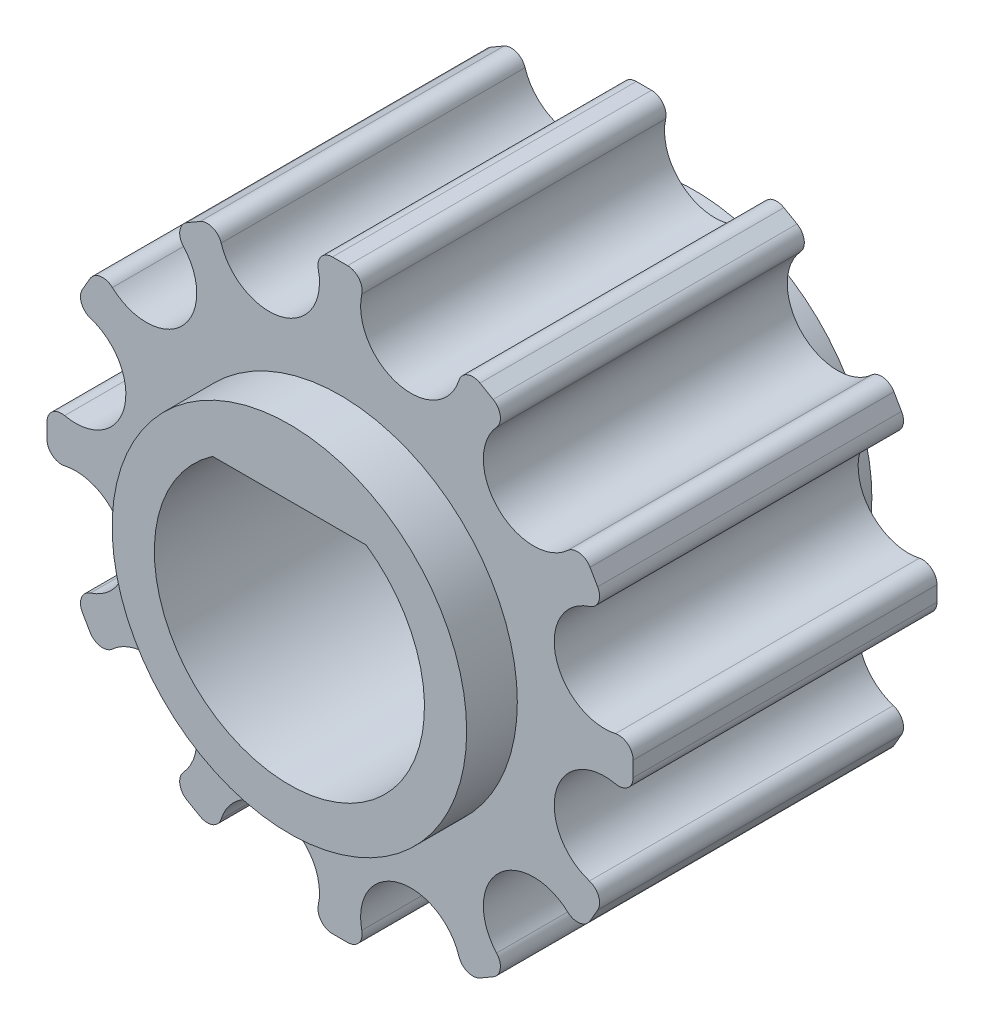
from build123d import *

# Parameters (mm, degrees)
SKETCH2_R               = 9.549296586
PD_DEPTH                = 4.5
TEETH_DEPTH             = 9
CIRPATTERN1_COUNT       = 12
CUT_EXTRUDE2_DEPTH      = 14.073269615
CUT_EXTRUDE2_DEPTH_BACK = 14.073269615
SKETCH8_R               = 5.25
BOSS_EXTRUDE2_DEPTH     = 1.5
BOSS_EXTRUDE3_START     = 1.5
SKETCH9_R               = 5.25
BOSS_EXTRUDE3_DEPTH     = 1.5


with BuildPart() as part:
    # Sketch2 → PD (new, symmetric)
    with BuildSketch(Plane.XY):
        Circle(SKETCH2_R)
    extrude(amount=PD_DEPTH, both=True)

    # Sketch3 → Teeth (cut)
    with BuildSketch(Plane.XY.offset(4.5)):
        with BuildLine():
            Line((0, 8.679296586), (0.224519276, 8.679296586))
            ThreePointArc((0.224519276, 8.679296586), (0.559923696, 8.518376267), (0.644289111, 8.156058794))
            ThreePointArc((0.644289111, 8.156058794), (1.713200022, 6.393749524), (3.52005866, 7.385498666))
            ThreePointArc((3.52005866, 7.385498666), (3.774279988, 7.657092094), (4.145208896, 7.628750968))
            Line((4.145208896, 7.628750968), (4.339648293, 7.51649133))
            Line((4.339648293, 7.51649133), (4.774648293, 8.269933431))
            ThreePointArc((4.774648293, 8.269933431), (2.471539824, 9.223912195), (0, 9.549296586))
            Line((0, 9.549296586), (0, 8.679296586))
        make_face()
    teeth = extrude(amount=-TEETH_DEPTH, mode=Mode.SUBTRACT)

    # CirPattern1: Teeth ×12 about axis
    cirpattern1_axis = Axis((0, 0, 0), (0, 0, 1))
    for i in range(1, CIRPATTERN1_COUNT):
        add(teeth.rotate(cirpattern1_axis, i * 360 / CIRPATTERN1_COUNT), mode=Mode.SUBTRACT)

    # Sketch6 → Cut-Extrude2 (cut, two sides: drawn at the far end of the back side and taken through both)
    with BuildSketch(Plane.XY.offset(-CUT_EXTRUDE2_DEPTH_BACK)):
        with BuildLine():
            Line((2.275349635, 3.2898), (0, 3.2898))
            Line((0, 3.2898), (-2.275349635, 3.2898))
            ThreePointArc((-2.275349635, 3.2898), (-1.857229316, -3.54269661), (4, 0))
            ThreePointArc((4, 0), (3.54269661, 1.857229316), (2.275349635, 3.2898))
        make_face()
    extrude(amount=CUT_EXTRUDE2_DEPTH + CUT_EXTRUDE2_DEPTH_BACK, mode=Mode.SUBTRACT)

    # Sketch8 → Boss-Extrude2 (add)
    with BuildSketch(Plane.XY.offset(4.5)):
        Circle(SKETCH8_R)
        with BuildLine():
            Line((-2.275349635, 3.2898), (2.275349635, 3.2898))
            ThreePointArc((2.275349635, 3.2898), (0, -4), (-2.275349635, 3.2898))
        make_face(mode=Mode.SUBTRACT)
    extrude(amount=BOSS_EXTRUDE2_DEPTH)

    # Sketch9 → Boss-Extrude3 (add)
    with BuildSketch(Plane(origin=(0, 0, -4.5), x_dir=(-1, 0, 0), z_dir=(0, 0, -1)).offset(BOSS_EXTRUDE3_START)):
        with Locations(Location((0, 0, 0), (0, 0, 180))):
            Circle(SKETCH9_R)
        with BuildLine():
            Line((-2.275349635, 3.2898), (2.275349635, 3.2898))
            ThreePointArc((2.275349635, 3.2898), (0, -4), (-2.275349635, 3.2898))
        make_face(mode=Mode.SUBTRACT)
    extrude(amount=-BOSS_EXTRUDE3_DEPTH)


solid = part.part
